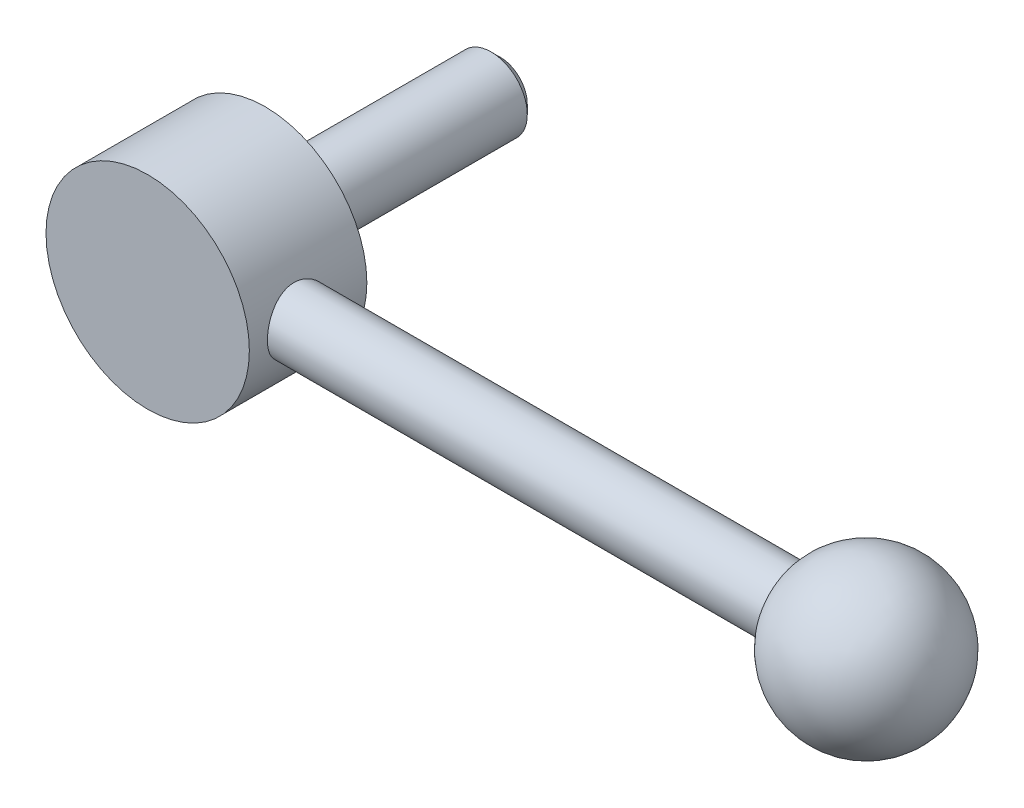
ISO-10303-21;
HEADER;
FILE_DESCRIPTION(('STEP AP214'),'2;1');
FILE_NAME('part.step','',(''),(''),'','','');
FILE_SCHEMA(('AUTOMOTIVE_DESIGN { 1 0 10303 214 1 1 1 1 }'));
ENDSEC;
DATA;
#1=APPLICATION_CONTEXT('core data for automotive mechanical design processes');
#2=APPLICATION_PROTOCOL_DEFINITION('international standard','automotive_design',2000,#1);
#3=PRODUCT_CONTEXT('',#1,'mechanical');
#4=PRODUCT('Part','Part','',(#3));
#5=PRODUCT_RELATED_PRODUCT_CATEGORY('part','',(#4));
#6=PRODUCT_DEFINITION_FORMATION('','',#4);
#7=PRODUCT_DEFINITION_CONTEXT('part definition',#1,'design');
#8=PRODUCT_DEFINITION('design','',#6,#7);
#9=PRODUCT_DEFINITION_SHAPE('','',#8);
#10=(LENGTH_UNIT() NAMED_UNIT(*) SI_UNIT(.MILLI.,.METRE.));
#11=(NAMED_UNIT(*) PLANE_ANGLE_UNIT() SI_UNIT($,.RADIAN.));
#12=(NAMED_UNIT(*) SI_UNIT($,.STERADIAN.) SOLID_ANGLE_UNIT());
#13=UNCERTAINTY_MEASURE_WITH_UNIT(LENGTH_MEASURE(1.E-05),#10,'distance_accuracy_value','');
#14=(GEOMETRIC_REPRESENTATION_CONTEXT(3) GLOBAL_UNCERTAINTY_ASSIGNED_CONTEXT((#13)) GLOBAL_UNIT_ASSIGNED_CONTEXT((#10,
#11,#12)) REPRESENTATION_CONTEXT('',''));
#15=CARTESIAN_POINT('',(0.,0.,0.));
#16=DIRECTION('',(0.,0.,1.));
#17=DIRECTION('',(1.,0.,0.));
#18=AXIS2_PLACEMENT_3D('',#15,#16,#17);
#19=CARTESIAN_POINT('',(0.,0.,40.));
#20=DIRECTION('',(0.,0.,1.));
#21=DIRECTION('',(1.,0.,0.));
#22=AXIS2_PLACEMENT_3D('',#19,#20,#21);
#23=CYLINDRICAL_SURFACE('',#22,11.5);
#24=CARTESIAN_POINT('',(0.,0.,2.));
#25=DIRECTION('',(0.,0.,1.));
#26=DIRECTION('',(1.,0.,0.));
#27=AXIS2_PLACEMENT_3D('',#24,#25,#26);
#28=CIRCLE('',#27,11.5);
#29=CARTESIAN_POINT('',(11.5,0.,2.));
#30=VERTEX_POINT('',#29);
#31=EDGE_CURVE('E37',#30,#30,#28,.T.);
#32=ORIENTED_EDGE('',*,*,#31,.F.);
#33=EDGE_LOOP('',(#32));
#34=FACE_BOUND('',#33,.T.);
#35=CARTESIAN_POINT('',(0.,0.,0.));
#36=DIRECTION('',(0.,0.,1.));
#37=DIRECTION('',(1.,0.,0.));
#38=AXIS2_PLACEMENT_3D('',#35,#36,#37);
#39=CIRCLE('',#38,11.5);
#40=CARTESIAN_POINT('',(11.5,0.,0.));
#41=VERTEX_POINT('',#40);
#42=EDGE_CURVE('E23',#41,#41,#39,.T.);
#43=ORIENTED_EDGE('',*,*,#42,.T.);
#44=EDGE_LOOP('',(#43));
#45=FACE_BOUND('',#44,.T.);
#46=ADVANCED_FACE('F12',(#34,#45),#23,.T.);
#47=CARTESIAN_POINT('',(8.,0.,0.));
#48=DIRECTION('',(0.,0.,1.));
#49=DIRECTION('',(1.,0.,0.));
#50=AXIS2_PLACEMENT_3D('',#47,#48,#49);
#51=PLANE('',#50);
#52=ORIENTED_EDGE('',*,*,#42,.F.);
#53=EDGE_LOOP('',(#52));
#54=FACE_BOUND('',#53,.T.);
#55=CARTESIAN_POINT('',(0.,0.,0.));
#56=DIRECTION('',(0.,0.,1.));
#57=DIRECTION('',(1.,0.,0.));
#58=AXIS2_PLACEMENT_3D('',#55,#56,#57);
#59=CIRCLE('',#58,8.);
#60=CARTESIAN_POINT('',(8.,0.,0.));
#61=VERTEX_POINT('',#60);
#62=EDGE_CURVE('E27',#61,#61,#59,.T.);
#63=ORIENTED_EDGE('',*,*,#62,.T.);
#64=EDGE_LOOP('',(#63));
#65=FACE_BOUND('',#64,.T.);
#66=ADVANCED_FACE('F63',(#54,#65),#51,.F.);
#67=CARTESIAN_POINT('',(0.,0.,40.));
#68=DIRECTION('',(0.,0.,1.));
#69=DIRECTION('',(1.,0.,0.));
#70=AXIS2_PLACEMENT_3D('',#67,#68,#69);
#71=CYLINDRICAL_SURFACE('',#70,8.);
#72=CARTESIAN_POINT('',(0.,0.,-48.));
#73=DIRECTION('',(0.,0.,-1.));
#74=DIRECTION('',(-1.,0.,0.));
#75=AXIS2_PLACEMENT_3D('',#72,#73,#74);
#76=CIRCLE('',#75,8.);
#77=CARTESIAN_POINT('',(-8.,0.,-48.));
#78=VERTEX_POINT('',#77);
#79=EDGE_CURVE('E19',#78,#78,#76,.F.);
#80=ORIENTED_EDGE('',*,*,#79,.T.);
#81=EDGE_LOOP('',(#80));
#82=FACE_BOUND('',#81,.T.);
#83=ORIENTED_EDGE('',*,*,#62,.F.);
#84=EDGE_LOOP('',(#83));
#85=FACE_BOUND('',#84,.T.);
#86=ADVANCED_FACE('F69',(#82,#85),#71,.T.);
#87=CARTESIAN_POINT('',(8.,0.,-50.));
#88=DIRECTION('',(0.,0.,-1.));
#89=DIRECTION('',(-1.,0.,0.));
#90=AXIS2_PLACEMENT_3D('',#87,#88,#89);
#91=PLANE('',#90);
#92=CARTESIAN_POINT('',(0.,0.,-50.));
#93=DIRECTION('',(0.,0.,-1.));
#94=DIRECTION('',(-1.,0.,0.));
#95=AXIS2_PLACEMENT_3D('',#92,#93,#94);
#96=CIRCLE('',#95,6.);
#97=CARTESIAN_POINT('',(-6.,0.,-50.));
#98=VERTEX_POINT('',#97);
#99=EDGE_CURVE('E8',#98,#98,#96,.T.);
#100=ORIENTED_EDGE('',*,*,#99,.T.);
#101=EDGE_LOOP('',(#100));
#102=FACE_BOUND('',#101,.T.);
#103=ADVANCED_FACE('F77',(#102),#91,.T.);
#104=CARTESIAN_POINT('',(22.5,0.,28.));
#105=DIRECTION('',(0.,0.,-1.));
#106=DIRECTION('',(-1.,0.,0.));
#107=AXIS2_PLACEMENT_3D('',#104,#105,#106);
#108=PLANE('',#107);
#109=CARTESIAN_POINT('',(0.,0.,28.));
#110=DIRECTION('',(0.,0.,1.));
#111=DIRECTION('',(1.,0.,0.));
#112=AXIS2_PLACEMENT_3D('',#109,#110,#111);
#113=CIRCLE('',#112,22.5);
#114=CARTESIAN_POINT('',(22.5,0.,28.));
#115=VERTEX_POINT('',#114);
#116=EDGE_CURVE('E86',#115,#115,#113,.T.);
#117=ORIENTED_EDGE('',*,*,#116,.T.);
#118=EDGE_LOOP('',(#117));
#119=FACE_BOUND('',#118,.T.);
#120=ADVANCED_FACE('F58',(#119),#108,.F.);
#121=CARTESIAN_POINT('',(0.,0.,40.));
#122=DIRECTION('',(0.,0.,1.));
#123=DIRECTION('',(1.,0.,0.));
#124=AXIS2_PLACEMENT_3D('',#121,#122,#123);
#125=CYLINDRICAL_SURFACE('',#124,22.5);
#126=CARTESIAN_POINT('',(22.5,0.,10.));
#127=CARTESIAN_POINT('',(22.4999998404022,-0.191677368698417,10.0000002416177));
#128=CARTESIAN_POINT('',(22.4975448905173,-0.383358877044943,10.0078793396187));
#129=CARTESIAN_POINT('',(22.4877923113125,-0.765308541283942,10.0393229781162));
#130=CARTESIAN_POINT('',(22.4804945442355,-0.955576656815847,10.0628879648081));
#131=CARTESIAN_POINT('',(22.4612564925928,-1.33331254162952,10.1254869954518));
#132=CARTESIAN_POINT('',(22.4493161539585,-1.52078027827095,10.1645212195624));
#133=CARTESIAN_POINT('',(22.4211118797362,-1.89165112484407,10.2577281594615));
#134=CARTESIAN_POINT('',(22.4048463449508,-2.07505270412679,10.3119064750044));
#135=CARTESIAN_POINT('',(22.3684646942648,-2.43611329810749,10.4348153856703));
#136=CARTESIAN_POINT('',(22.3483561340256,-2.61378279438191,10.503517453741));
#137=CARTESIAN_POINT('',(22.3047888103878,-2.96265393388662,10.6550124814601));
#138=CARTESIAN_POINT('',(22.281328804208,-3.13385314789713,10.7378106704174));
#139=CARTESIAN_POINT('',(22.2316747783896,-3.46860942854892,10.9168465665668));
#140=CARTESIAN_POINT('',(22.2054814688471,-3.63216846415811,11.0130807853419));
#141=CARTESIAN_POINT('',(22.1510251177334,-3.95072830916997,11.2183306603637));
#142=CARTESIAN_POINT('',(22.1227612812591,-4.10572579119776,11.327351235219));
#143=CARTESIAN_POINT('',(22.0343532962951,-4.56462383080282,11.6788046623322));
#144=CARTESIAN_POINT('',(21.9719820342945,-4.85343322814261,11.9408249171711));
#145=CARTESIAN_POINT('',(21.8481078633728,-5.38374028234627,12.5092913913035));
#146=CARTESIAN_POINT('',(21.7866051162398,-5.62522922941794,12.8157457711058));
#147=CARTESIAN_POINT('',(21.6993823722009,-5.94977072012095,13.3067462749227));
#148=CARTESIAN_POINT('',(21.670827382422,-6.05269326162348,13.4779461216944));
#149=CARTESIAN_POINT('',(21.6165738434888,-6.24368405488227,13.8288405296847));
#150=CARTESIAN_POINT('',(21.5908741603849,-6.33175821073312,14.0085316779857));
#151=CARTESIAN_POINT('',(21.5431267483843,-6.49235835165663,14.3752387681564));
#152=CARTESIAN_POINT('',(21.5210797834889,-6.56488108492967,14.5622562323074));
#153=CARTESIAN_POINT('',(21.4813641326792,-6.69369414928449,14.9421700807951));
#154=CARTESIAN_POINT('',(21.4636935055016,-6.74999167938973,15.1350638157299));
#155=CARTESIAN_POINT('',(21.4337574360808,-6.84444485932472,15.5195916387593));
#156=CARTESIAN_POINT('',(21.4213480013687,-6.88308642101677,15.7110952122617));
#157=CARTESIAN_POINT('',(21.4016029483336,-6.94423696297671,16.0968445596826));
#158=CARTESIAN_POINT('',(21.3942652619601,-6.96675251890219,16.2910891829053));
#159=CARTESIAN_POINT('',(21.3848978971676,-6.99545358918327,16.6809027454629));
#160=CARTESIAN_POINT('',(21.382868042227,-7.00163964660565,16.8764716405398));
#161=CARTESIAN_POINT('',(21.3841835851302,-6.99762087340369,17.2674203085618));
#162=CARTESIAN_POINT('',(21.387528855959,-6.98741643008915,17.4628000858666));
#163=CARTESIAN_POINT('',(21.3992467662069,-6.95144410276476,17.8441910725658));
#164=CARTESIAN_POINT('',(21.4074162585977,-6.92630487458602,18.0302682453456));
#165=CARTESIAN_POINT('',(21.4283669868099,-6.86121389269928,18.3996136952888));
#166=CARTESIAN_POINT('',(21.4411497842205,-6.82125712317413,18.5828809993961));
#167=CARTESIAN_POINT('',(21.4709424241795,-6.7268919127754,18.9452428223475));
#168=CARTESIAN_POINT('',(21.4879510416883,-6.67248765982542,19.1243385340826));
#169=CARTESIAN_POINT('',(21.5257120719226,-6.54964475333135,19.4773149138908));
#170=CARTESIAN_POINT('',(21.5464659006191,-6.48120079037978,19.6511935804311));
#171=CARTESIAN_POINT('',(21.5914465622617,-6.32975192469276,19.9949996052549));
#172=CARTESIAN_POINT('',(21.6157183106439,-6.24655500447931,20.1648364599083));
#173=CARTESIAN_POINT('',(21.6668400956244,-6.06685791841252,20.4969847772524));
#174=CARTESIAN_POINT('',(21.6936910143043,-5.97035319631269,20.6592936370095));
#175=CARTESIAN_POINT('',(21.749239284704,-5.76471421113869,20.9753768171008));
#176=CARTESIAN_POINT('',(21.777936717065,-5.65557939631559,21.1291507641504));
#177=CARTESIAN_POINT('',(21.836423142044,-5.42537787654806,21.4272728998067));
#178=CARTESIAN_POINT('',(21.866212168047,-5.30431080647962,21.5716207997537));
#179=CARTESIAN_POINT('',(21.9274745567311,-5.0452320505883,21.8563713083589));
#180=CARTESIAN_POINT('',(21.958963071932,-4.90670110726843,21.9962986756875));
#181=CARTESIAN_POINT('',(22.0214157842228,-4.61833304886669,22.2639997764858));
#182=CARTESIAN_POINT('',(22.0523801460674,-4.46849957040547,22.3917773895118));
#183=CARTESIAN_POINT('',(22.1129608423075,-4.15835706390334,22.6344343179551));
#184=CARTESIAN_POINT('',(22.142576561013,-3.99804333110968,22.749307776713));
#185=CARTESIAN_POINT('',(22.1996210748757,-3.66808403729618,22.9652340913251));
#186=CARTESIAN_POINT('',(22.2270507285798,-3.4984421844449,23.0662923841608));
#187=CARTESIAN_POINT('',(22.2791891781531,-3.14946058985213,23.2546406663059));
#188=CARTESIAN_POINT('',(22.3038740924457,-2.97005333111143,23.341812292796));
#189=CARTESIAN_POINT('',(22.3495532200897,-2.60412187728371,23.5006396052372));
#190=CARTESIAN_POINT('',(22.3705488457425,-2.41760043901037,23.5723012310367));
#191=CARTESIAN_POINT('',(22.4082535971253,-2.03872672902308,23.6995165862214));
#192=CARTESIAN_POINT('',(22.4249629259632,-1.84637473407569,23.7550710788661));
#193=CARTESIAN_POINT('',(22.4536048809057,-1.45728257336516,23.8495549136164));
#194=CARTESIAN_POINT('',(22.4655376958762,-1.26054258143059,23.8884849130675));
#195=CARTESIAN_POINT('',(22.4839130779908,-0.871811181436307,23.948173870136));
#196=CARTESIAN_POINT('',(22.4905485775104,-0.679926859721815,23.9695722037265));
#197=CARTESIAN_POINT('',(22.4988905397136,-0.294941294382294,23.9964448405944));
#198=CARTESIAN_POINT('',(22.5005971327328,-0.101840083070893,24.001919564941));
#199=CARTESIAN_POINT('',(22.4990337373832,0.284107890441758,23.9968939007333));
#200=CARTESIAN_POINT('',(22.4957643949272,0.476954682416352,23.9863955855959));
#201=CARTESIAN_POINT('',(22.4843416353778,0.860977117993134,23.9495270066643));
#202=CARTESIAN_POINT('',(22.4761882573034,1.0521527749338,23.9231568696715));
#203=CARTESIAN_POINT('',(22.4554847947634,1.42671362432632,23.8556400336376));
#204=CARTESIAN_POINT('',(22.4430488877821,1.61017439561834,23.8148764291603));
#205=CARTESIAN_POINT('',(22.4140684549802,1.97298394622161,23.7188213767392));
#206=CARTESIAN_POINT('',(22.3975225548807,2.15233132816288,23.6635250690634));
#207=CARTESIAN_POINT('',(22.3607552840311,2.50562583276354,23.5388775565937));
#208=CARTESIAN_POINT('',(22.3405349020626,2.67957439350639,23.4695301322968));
#209=CARTESIAN_POINT('',(22.2969201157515,3.02109307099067,23.3172751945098));
#210=CARTESIAN_POINT('',(22.2735245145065,3.18866075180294,23.2343625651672));
#211=CARTESIAN_POINT('',(22.2235592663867,3.5202550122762,23.0534553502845));
#212=CARTESIAN_POINT('',(22.196927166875,3.68410148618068,22.9551479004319));
#213=CARTESIAN_POINT('',(22.1416334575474,4.00303333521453,22.7456195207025));
#214=CARTESIAN_POINT('',(22.1129711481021,4.15811565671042,22.6343941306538));
#215=CARTESIAN_POINT('',(22.0543595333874,4.45854845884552,22.3997845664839));
#216=CARTESIAN_POINT('',(22.0244101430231,4.60389829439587,22.2763995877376));
#217=CARTESIAN_POINT('',(21.9639950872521,4.88399953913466,22.0182492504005));
#218=CARTESIAN_POINT('',(21.9335294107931,5.01875072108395,21.8834836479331));
#219=CARTESIAN_POINT('',(21.8716714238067,5.28194864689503,21.5978479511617));
#220=CARTESIAN_POINT('',(21.8402900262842,5.40993633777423,21.446552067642));
#221=CARTESIAN_POINT('',(21.778722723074,5.65269114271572,21.133557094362));
#222=CARTESIAN_POINT('',(21.7485364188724,5.7674626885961,20.9718615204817));
#223=CARTESIAN_POINT('',(21.6902133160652,5.98307012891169,20.6389845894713));
#224=CARTESIAN_POINT('',(21.6620773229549,6.08390056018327,20.4677995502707));
#225=CARTESIAN_POINT('',(21.6087222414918,6.27077082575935,20.1171905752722));
#226=CARTESIAN_POINT('',(21.5835019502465,6.35681676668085,19.9377700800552));
#227=CARTESIAN_POINT('',(21.5368298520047,6.51318654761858,19.5724944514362));
#228=CARTESIAN_POINT('',(21.5153649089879,6.58356543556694,19.3866645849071));
#229=CARTESIAN_POINT('',(21.4767854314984,6.70834974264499,19.0093553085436));
#230=CARTESIAN_POINT('',(21.4596691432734,6.76276160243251,18.8178782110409));
#231=CARTESIAN_POINT('',(21.4303403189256,6.85513428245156,18.4306463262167));
#232=CARTESIAN_POINT('',(21.4181272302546,6.89309695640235,18.2348920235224));
#233=CARTESIAN_POINT('',(21.3990152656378,6.95220219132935,17.8406058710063));
#234=CARTESIAN_POINT('',(21.3921161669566,6.97334545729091,17.6420741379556));
#235=CARTESIAN_POINT('',(21.3840536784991,6.99802863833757,17.2527924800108));
#236=CARTESIAN_POINT('',(21.3826459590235,7.00231848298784,17.0620947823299));
#237=CARTESIAN_POINT('',(21.3849355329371,6.99532322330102,16.6809486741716));
#238=CARTESIAN_POINT('',(21.3886345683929,6.98403280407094,16.4905003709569));
#239=CARTESIAN_POINT('',(21.4010215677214,6.94598254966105,16.1114036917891));
#240=CARTESIAN_POINT('',(21.4097074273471,6.91922923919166,15.9227545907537));
#241=CARTESIAN_POINT('',(21.4317998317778,6.8504931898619,15.5484622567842));
#242=CARTESIAN_POINT('',(21.445208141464,6.80850475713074,15.3628201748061));
#243=CARTESIAN_POINT('',(21.4761044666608,6.7104051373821,14.9986247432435));
#244=CARTESIAN_POINT('',(21.4935291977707,6.65451205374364,14.8200071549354));
#245=CARTESIAN_POINT('',(21.532065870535,6.52874130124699,14.4681109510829));
#246=CARTESIAN_POINT('',(21.553179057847,6.45885890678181,14.294834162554));
#247=CARTESIAN_POINT('',(21.598497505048,6.30565478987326,13.9547580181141));
#248=CARTESIAN_POINT('',(21.622702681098,6.22233343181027,13.7879584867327));
#249=CARTESIAN_POINT('',(21.6735512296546,6.04283665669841,13.4618116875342));
#250=CARTESIAN_POINT('',(21.7001947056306,5.94666069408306,13.3024647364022));
#251=CARTESIAN_POINT('',(21.7562945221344,5.73809693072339,12.9860832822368));
#252=CARTESIAN_POINT('',(21.7858200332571,5.62522322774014,12.8293812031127));
#253=CARTESIAN_POINT('',(21.8459271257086,5.38707171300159,12.5260042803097));
#254=CARTESIAN_POINT('',(21.876508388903,5.26179761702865,12.3793264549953));
#255=CARTESIAN_POINT('',(21.9379319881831,4.9995285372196,12.0967465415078));
#256=CARTESIAN_POINT('',(21.9687744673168,4.86252669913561,11.9608508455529));
#257=CARTESIAN_POINT('',(22.0298741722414,4.57775496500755,11.7008184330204));
#258=CARTESIAN_POINT('',(22.0601315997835,4.42998886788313,11.5766776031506));
#259=CARTESIAN_POINT('',(22.1202447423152,4.11953578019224,11.3370395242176));
#260=CARTESIAN_POINT('',(22.1500549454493,3.95651883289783,11.2219578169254));
#261=CARTESIAN_POINT('',(22.207366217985,3.62102613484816,11.0060070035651));
#262=CARTESIAN_POINT('',(22.2348681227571,3.44855384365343,10.9051327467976));
#263=CARTESIAN_POINT('',(22.286793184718,3.09527336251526,10.7183440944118));
#264=CARTESIAN_POINT('',(22.3112167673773,2.91446632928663,10.6324276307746));
#265=CARTESIAN_POINT('',(22.3562872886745,2.54576090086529,10.4762606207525));
#266=CARTESIAN_POINT('',(22.3769345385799,2.35786309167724,10.4060087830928));
#267=CARTESIAN_POINT('',(22.4122437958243,1.99297373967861,10.2872063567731));
#268=CARTESIAN_POINT('',(22.4272705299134,1.81645819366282,10.2372983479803));
#269=CARTESIAN_POINT('',(22.4533075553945,1.45977603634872,10.1514456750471));
#270=CARTESIAN_POINT('',(22.4643180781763,1.27960963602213,10.1155002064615));
#271=CARTESIAN_POINT('',(22.4820479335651,0.916792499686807,10.0578654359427));
#272=CARTESIAN_POINT('',(22.4887670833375,0.734141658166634,10.0361767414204));
#273=CARTESIAN_POINT('',(22.4977423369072,0.36766149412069,10.007246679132));
#274=CARTESIAN_POINT('',(22.500000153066,0.183832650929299,9.99999976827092));
#275=CARTESIAN_POINT('',(22.5,0.,10.));
#276=B_SPLINE_CURVE_WITH_KNOTS('',3,(#126,#127,#128,#129,#130,#131,#132,#133,#134,#135,#136,
#137,#138,#139,#140,#141,#142,#143,#144,#145,#146,#147,#148,#149,#150,#151,#152,#153,#154,#155,
#156,#157,#158,#159,#160,#161,#162,#163,#164,#165,#166,#167,#168,#169,#170,#171,#172,#173,#174,
#175,#176,#177,#178,#179,#180,#181,#182,#183,#184,#185,#186,#187,#188,#189,#190,#191,#192,#193,
#194,#195,#196,#197,#198,#199,#200,#201,#202,#203,#204,#205,#206,#207,#208,#209,#210,#211,#212,
#213,#214,#215,#216,#217,#218,#219,#220,#221,#222,#223,#224,#225,#226,#227,#228,#229,#230,#231,
#232,#233,#234,#235,#236,#237,#238,#239,#240,#241,#242,#243,#244,#245,#246,#247,#248,#249,#250,
#251,#252,#253,#254,#255,#256,#257,#258,#259,#260,#261,#262,#263,#264,#265,#266,#267,#268,#269,
#270,#271,#272,#273,#274,#275),.UNSPECIFIED.,.T.,.F.,(4,2,2,2,2,2,2,2,2,2,2,2,2,2,2,2,2,2,2,2,2,
2,2,2,2,2,2,2,2,2,2,2,2,2,2,2,2,2,2,2,2,2,2,2,2,2,2,2,2,2,2,2,2,2,2,2,2,2,2,2,2,2,2,2,2,2,2,2,2,
2,2,2,2,2,4),(0.,0.574862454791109,1.14974126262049,1.72462676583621,2.29972512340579,
2.87370421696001,3.44789670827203,4.02194039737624,4.59620563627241,5.77524816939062,
6.95450751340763,7.55923977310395,8.16373100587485,8.76834851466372,9.37269734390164,
9.95922932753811,10.5455220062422,11.1317951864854,11.7180545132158,12.2812290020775,
12.8445943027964,13.4077964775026,13.9712120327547,14.5425858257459,15.1141557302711,
15.6857506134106,16.2573629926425,16.85487964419,17.4522048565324,18.0498000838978,
18.6471594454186,19.2493655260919,19.8513405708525,20.4532870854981,21.0552097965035,
21.6340578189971,22.2128905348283,22.7916481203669,23.3704010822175,23.9347859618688,
24.499359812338,25.0637819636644,25.6284174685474,26.2065358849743,26.7848545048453,
27.3632114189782,27.9415807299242,28.5427881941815,29.1437934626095,29.74503358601,
30.3460247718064,30.9448697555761,31.5434728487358,32.1420084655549,32.7405189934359,
33.3120739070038,33.8838238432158,34.4553327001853,35.0270553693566,35.5903206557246,
36.1537765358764,36.7172171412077,37.2806816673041,37.8661164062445,38.4513762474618,
39.0369805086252,39.6223790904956,40.2269255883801,40.8312523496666,41.4354954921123,
42.0396888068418,42.5912440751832,43.1427675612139,43.6943145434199,44.2456497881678),.UNSPECIFIED.);
#277=CARTESIAN_POINT('',(22.5,0.,10.));
#278=VERTEX_POINT('',#277);
#279=EDGE_CURVE('E30',#278,#278,#276,.T.);
#280=ORIENTED_EDGE('',*,*,#279,.T.);
#281=EDGE_LOOP('',(#280));
#282=FACE_BOUND('',#281,.T.);
#283=ORIENTED_EDGE('',*,*,#116,.F.);
#284=EDGE_LOOP('',(#283));
#285=FACE_BOUND('',#284,.T.);
#286=CARTESIAN_POINT('',(0.,0.,2.));
#287=DIRECTION('',(0.,0.,1.));
#288=DIRECTION('',(1.,0.,0.));
#289=AXIS2_PLACEMENT_3D('',#286,#287,#288);
#290=CIRCLE('',#289,22.5);
#291=CARTESIAN_POINT('',(22.5,0.,2.));
#292=VERTEX_POINT('',#291);
#293=EDGE_CURVE('E88',#292,#292,#290,.T.);
#294=ORIENTED_EDGE('',*,*,#293,.T.);
#295=EDGE_LOOP('',(#294));
#296=FACE_BOUND('',#295,.T.);
#297=ADVANCED_FACE('F40',(#282,#285,#296),#125,.T.);
#298=CARTESIAN_POINT('',(11.5,0.,2.));
#299=DIRECTION('',(0.,0.,1.));
#300=DIRECTION('',(1.,0.,0.));
#301=AXIS2_PLACEMENT_3D('',#298,#299,#300);
#302=PLANE('',#301);
#303=ORIENTED_EDGE('',*,*,#293,.F.);
#304=EDGE_LOOP('',(#303));
#305=FACE_BOUND('',#304,.T.);
#306=ORIENTED_EDGE('',*,*,#31,.T.);
#307=EDGE_LOOP('',(#306));
#308=FACE_BOUND('',#307,.T.);
#309=ADVANCED_FACE('F49',(#305,#308),#302,.F.);
#310=CARTESIAN_POINT('',(-30.,0.,17.));
#311=DIRECTION('',(-1.,0.,0.));
#312=DIRECTION('',(0.,0.,1.));
#313=AXIS2_PLACEMENT_3D('',#310,#311,#312);
#314=CYLINDRICAL_SURFACE('',#313,7.);
#315=CARTESIAN_POINT('',(131.960985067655,0.,17.));
#316=DIRECTION('',(-1.,0.,0.));
#317=DIRECTION('',(0.,0.,1.));
#318=AXIS2_PLACEMENT_3D('',#315,#316,#317);
#319=CIRCLE('',#318,7.);
#320=CARTESIAN_POINT('',(131.960985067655,0.,24.));
#321=VERTEX_POINT('',#320);
#322=EDGE_CURVE('E38',#321,#321,#319,.T.);
#323=ORIENTED_EDGE('',*,*,#322,.T.);
#324=EDGE_LOOP('',(#323));
#325=FACE_BOUND('',#324,.T.);
#326=ORIENTED_EDGE('',*,*,#279,.F.);
#327=EDGE_LOOP('',(#326));
#328=FACE_BOUND('',#327,.T.);
#329=ADVANCED_FACE('F44',(#325,#328),#314,.T.);
#330=CARTESIAN_POINT('',(148.,0.,17.));
#331=DIRECTION('',(0.,0.,1.));
#332=DIRECTION('',(1.,0.,0.));
#333=AXIS2_PLACEMENT_3D('',#330,#331,#332);
#334=SPHERICAL_SURFACE('',#333,17.5);
#335=CARTESIAN_POINT('',(148.,0.,17.));
#336=DIRECTION('',(-1.,0.,0.));
#337=DIRECTION('',(0.,0.,1.));
#338=AXIS2_PLACEMENT_3D('',#335,#336,#337);
#339=SPHERICAL_SURFACE('',#338,17.5);
#340=ORIENTED_EDGE('',*,*,#322,.F.);
#341=EDGE_LOOP('',(#340));
#342=FACE_BOUND('',#341,.T.);
#343=ADVANCED_FACE('F48',(#342),#339,.T.);
#344=CARTESIAN_POINT('',(0.,0.,-48.));
#345=DIRECTION('',(0.,0.,1.));
#346=DIRECTION('',(1.,0.,0.));
#347=AXIS2_PLACEMENT_3D('',#344,#345,#346);
#348=CONICAL_SURFACE('',#347,8.,0.78539816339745);
#349=ORIENTED_EDGE('',*,*,#99,.F.);
#350=EDGE_LOOP('',(#349));
#351=FACE_BOUND('',#350,.T.);
#352=ORIENTED_EDGE('',*,*,#79,.F.);
#353=EDGE_LOOP('',(#352));
#354=FACE_BOUND('',#353,.T.);
#355=ADVANCED_FACE('F14',(#351,#354),#348,.T.);
#356=CLOSED_SHELL('',(#46,#66,#86,#103,#120,#297,#309,#329,#343,#355));
#357=MANIFOLD_SOLID_BREP('B1',#356);
#358=ADVANCED_BREP_SHAPE_REPRESENTATION('',(#18,#357),#14);
#359=SHAPE_DEFINITION_REPRESENTATION(#9,#358);
ENDSEC;
END-ISO-10303-21;
